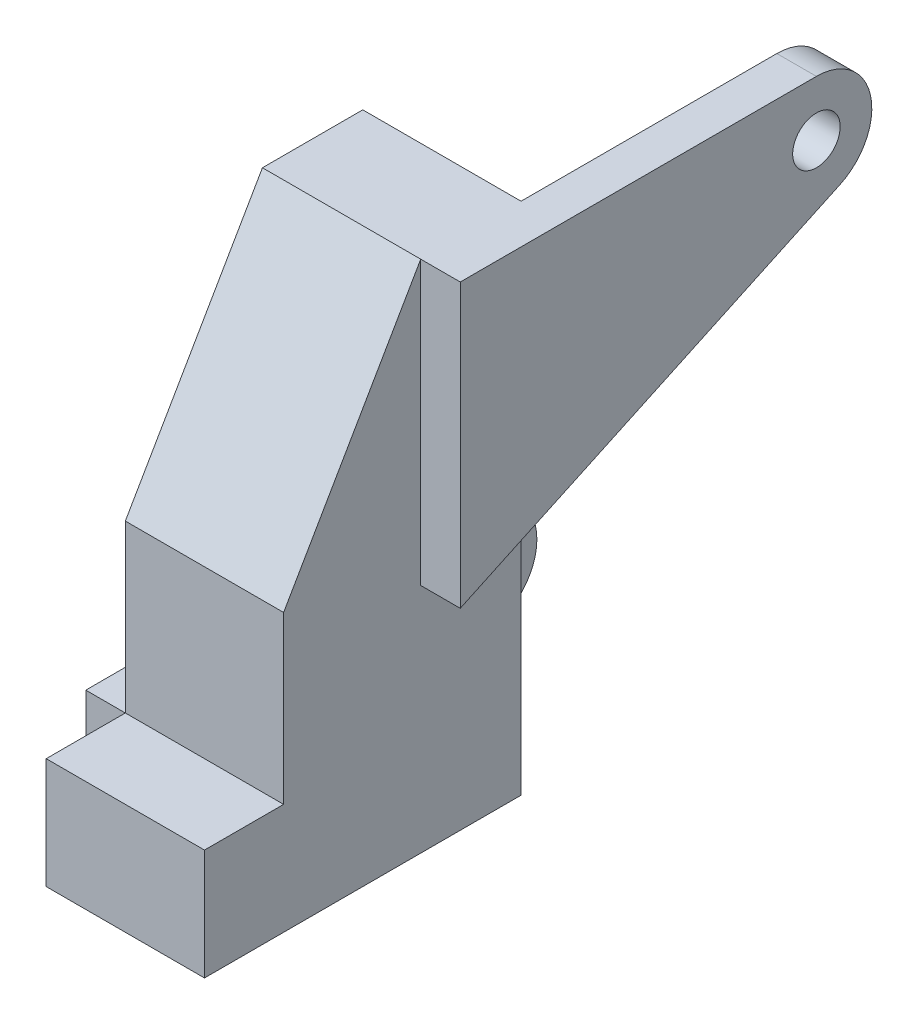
ISO-10303-21;
HEADER;
FILE_DESCRIPTION(('STEP AP214'),'2;1');
FILE_NAME('part.step','',(''),(''),'','','');
FILE_SCHEMA(('AUTOMOTIVE_DESIGN { 1 0 10303 214 1 1 1 1 }'));
ENDSEC;
DATA;
#1=APPLICATION_CONTEXT('core data for automotive mechanical design processes');
#2=APPLICATION_PROTOCOL_DEFINITION('international standard','automotive_design',2000,#1);
#3=PRODUCT_CONTEXT('',#1,'mechanical');
#4=PRODUCT('Part','Part','',(#3));
#5=PRODUCT_RELATED_PRODUCT_CATEGORY('part','',(#4));
#6=PRODUCT_DEFINITION_FORMATION('','',#4);
#7=PRODUCT_DEFINITION_CONTEXT('part definition',#1,'design');
#8=PRODUCT_DEFINITION('design','',#6,#7);
#9=PRODUCT_DEFINITION_SHAPE('','',#8);
#10=(LENGTH_UNIT() NAMED_UNIT(*) SI_UNIT(.MILLI.,.METRE.));
#11=(NAMED_UNIT(*) PLANE_ANGLE_UNIT() SI_UNIT($,.RADIAN.));
#12=(NAMED_UNIT(*) SI_UNIT($,.STERADIAN.) SOLID_ANGLE_UNIT());
#13=UNCERTAINTY_MEASURE_WITH_UNIT(LENGTH_MEASURE(1.E-05),#10,'distance_accuracy_value','');
#14=(GEOMETRIC_REPRESENTATION_CONTEXT(3) GLOBAL_UNCERTAINTY_ASSIGNED_CONTEXT((#13)) GLOBAL_UNIT_ASSIGNED_CONTEXT((#10,
#11,#12)) REPRESENTATION_CONTEXT('',''));
#15=CARTESIAN_POINT('',(0.,0.,0.));
#16=DIRECTION('',(0.,0.,1.));
#17=DIRECTION('',(1.,0.,0.));
#18=AXIS2_PLACEMENT_3D('',#15,#16,#17);
#19=CARTESIAN_POINT('',(0.,0.,0.));
#20=DIRECTION('',(-1.,0.,0.));
#21=DIRECTION('',(0.,0.,1.));
#22=AXIS2_PLACEMENT_3D('',#19,#20,#21);
#23=PLANE('',#22);
#24=DIRECTION('',(0.,0.,-1.));
#25=VECTOR('',#24,1.);
#26=CARTESIAN_POINT('',(0.,14.,-10.));
#27=LINE('',#26,#25);
#28=CARTESIAN_POINT('',(0.,14.,-10.));
#29=VERTEX_POINT('',#28);
#30=CARTESIAN_POINT('',(0.,14.,-40.));
#31=VERTEX_POINT('',#30);
#32=EDGE_CURVE('E177',#29,#31,#27,.T.);
#33=ORIENTED_EDGE('',*,*,#32,.F.);
#34=DIRECTION('',(0.,-1.,0.));
#35=VECTOR('',#34,1.);
#36=CARTESIAN_POINT('',(0.,14.,-10.));
#37=LINE('',#36,#35);
#38=CARTESIAN_POINT('',(0.,35.,-10.));
#39=VERTEX_POINT('',#38);
#40=EDGE_CURVE('E277',#39,#29,#37,.T.);
#41=ORIENTED_EDGE('',*,*,#40,.F.);
#42=DIRECTION('',(0.,-0.866025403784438,0.500000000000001));
#43=VECTOR('',#42,1.);
#44=CARTESIAN_POINT('',(0.,35.,-10.));
#45=LINE('',#44,#43);
#46=CARTESIAN_POINT('',(0.,65.,-27.3205080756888));
#47=VERTEX_POINT('',#46);
#48=EDGE_CURVE('E274',#47,#39,#45,.T.);
#49=ORIENTED_EDGE('',*,*,#48,.F.);
#50=DIRECTION('',(0.,0.,1.));
#51=VECTOR('',#50,1.);
#52=CARTESIAN_POINT('',(0.,65.,-27.3205080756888));
#53=LINE('',#52,#51);
#54=CARTESIAN_POINT('',(0.,65.,-40.));
#55=VERTEX_POINT('',#54);
#56=EDGE_CURVE('E271',#55,#47,#53,.T.);
#57=ORIENTED_EDGE('',*,*,#56,.F.);
#58=DIRECTION('',(0.,1.,0.));
#59=VECTOR('',#58,1.);
#60=CARTESIAN_POINT('',(0.,65.,-40.));
#61=LINE('',#60,#59);
#62=EDGE_CURVE('E61',#31,#55,#61,.T.);
#63=ORIENTED_EDGE('',*,*,#62,.F.);
#64=EDGE_LOOP('',(#33,#41,#49,#57,#63));
#65=FACE_BOUND('',#64,.T.);
#66=ADVANCED_FACE('F45',(#65),#23,.T.);
#67=CARTESIAN_POINT('',(20.,0.,0.));
#68=DIRECTION('',(-1.,0.,0.));
#69=DIRECTION('',(0.,0.,1.));
#70=AXIS2_PLACEMENT_3D('',#67,#68,#69);
#71=PLANE('',#70);
#72=DIRECTION('',(0.,0.422618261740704,-0.906307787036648));
#73=VECTOR('',#72,1.);
#74=CARTESIAN_POINT('',(20.,29.2925099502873,-27.3205080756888));
#75=LINE('',#74,#73);
#76=CARTESIAN_POINT('',(20.,29.2925099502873,-27.3205080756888));
#77=VERTEX_POINT('',#76);
#78=CARTESIAN_POINT('',(20.,35.2050541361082,-40.));
#79=VERTEX_POINT('',#78);
#80=EDGE_CURVE('E221',#77,#79,#75,.T.);
#81=ORIENTED_EDGE('',*,*,#80,.F.);
#82=DIRECTION('',(0.,-1.,0.));
#83=VECTOR('',#82,1.);
#84=CARTESIAN_POINT('',(20.,65.,-27.3205080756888));
#85=LINE('',#84,#83);
#86=CARTESIAN_POINT('',(20.,65.,-27.3205080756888));
#87=VERTEX_POINT('',#86);
#88=EDGE_CURVE('E216',#87,#77,#85,.T.);
#89=ORIENTED_EDGE('',*,*,#88,.F.);
#90=DIRECTION('',(0.,-0.866025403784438,0.500000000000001));
#91=VECTOR('',#90,1.);
#92=CARTESIAN_POINT('',(20.,35.,-10.));
#93=LINE('',#92,#91);
#94=CARTESIAN_POINT('',(20.,35.,-10.));
#95=VERTEX_POINT('',#94);
#96=EDGE_CURVE('E253',#87,#95,#93,.T.);
#97=ORIENTED_EDGE('',*,*,#96,.T.);
#98=DIRECTION('',(0.,-1.,0.));
#99=VECTOR('',#98,1.);
#100=CARTESIAN_POINT('',(20.,14.,-10.));
#101=LINE('',#100,#99);
#102=CARTESIAN_POINT('',(20.,14.,-10.));
#103=VERTEX_POINT('',#102);
#104=EDGE_CURVE('E256',#95,#103,#101,.T.);
#105=ORIENTED_EDGE('',*,*,#104,.T.);
#106=DIRECTION('',(0.,0.,1.));
#107=VECTOR('',#106,1.);
#108=CARTESIAN_POINT('',(20.,14.,0.));
#109=LINE('',#108,#107);
#110=CARTESIAN_POINT('',(20.,14.,0.));
#111=VERTEX_POINT('',#110);
#112=EDGE_CURVE('E259',#103,#111,#109,.T.);
#113=ORIENTED_EDGE('',*,*,#112,.T.);
#114=DIRECTION('',(0.,-1.,0.));
#115=VECTOR('',#114,1.);
#116=CARTESIAN_POINT('',(20.,0.,0.));
#117=LINE('',#116,#115);
#118=CARTESIAN_POINT('',(20.,0.,0.));
#119=VERTEX_POINT('',#118);
#120=EDGE_CURVE('E262',#111,#119,#117,.T.);
#121=ORIENTED_EDGE('',*,*,#120,.T.);
#122=DIRECTION('',(0.,0.,-1.));
#123=VECTOR('',#122,1.);
#124=CARTESIAN_POINT('',(20.,-4.031179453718E-13,-40.));
#125=LINE('',#124,#123);
#126=CARTESIAN_POINT('',(20.,-4.031179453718E-13,-40.));
#127=VERTEX_POINT('',#126);
#128=EDGE_CURVE('E243',#119,#127,#125,.T.);
#129=ORIENTED_EDGE('',*,*,#128,.T.);
#130=DIRECTION('',(0.,1.,0.));
#131=VECTOR('',#130,1.);
#132=CARTESIAN_POINT('',(20.,65.,-40.));
#133=LINE('',#132,#131);
#134=EDGE_CURVE('E249',#127,#79,#133,.T.);
#135=ORIENTED_EDGE('',*,*,#134,.T.);
#136=EDGE_LOOP('',(#81,#89,#97,#105,#113,#121,#129,#135));
#137=FACE_BOUND('',#136,.T.);
#138=ADVANCED_FACE('F324',(#137),#71,.F.);
#139=CARTESIAN_POINT('',(20.,-4.031179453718E-13,-40.));
#140=DIRECTION('',(0.,1.,0.));
#141=DIRECTION('',(0.,0.,1.));
#142=AXIS2_PLACEMENT_3D('',#139,#140,#141);
#143=PLANE('',#142);
#144=DIRECTION('',(0.,0.,-1.));
#145=VECTOR('',#144,1.);
#146=CARTESIAN_POINT('',(0.,-4.031179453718E-13,-40.));
#147=LINE('',#146,#145);
#148=CARTESIAN_POINT('',(0.,0.,0.));
#149=VERTEX_POINT('',#148);
#150=CARTESIAN_POINT('',(0.,-1.0077948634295E-13,-10.));
#151=VERTEX_POINT('',#150);
#152=EDGE_CURVE('E242',#149,#151,#147,.T.);
#153=ORIENTED_EDGE('',*,*,#152,.T.);
#154=DIRECTION('',(1.,0.,0.));
#155=VECTOR('',#154,1.);
#156=CARTESIAN_POINT('',(-5.,0.,-10.));
#157=LINE('',#156,#155);
#158=CARTESIAN_POINT('',(-5.,0.,-10.));
#159=VERTEX_POINT('',#158);
#160=EDGE_CURVE('E161',#159,#151,#157,.T.);
#161=ORIENTED_EDGE('',*,*,#160,.F.);
#162=DIRECTION('',(0.,0.,1.));
#163=VECTOR('',#162,1.);
#164=CARTESIAN_POINT('',(-5.,0.,-55.));
#165=LINE('',#164,#163);
#166=CARTESIAN_POINT('',(-5.,0.,-55.));
#167=VERTEX_POINT('',#166);
#168=EDGE_CURVE('E154',#167,#159,#165,.T.);
#169=ORIENTED_EDGE('',*,*,#168,.F.);
#170=DIRECTION('',(1.,0.,0.));
#171=VECTOR('',#170,1.);
#172=CARTESIAN_POINT('',(-5.,0.,-55.));
#173=LINE('',#172,#171);
#174=CARTESIAN_POINT('',(0.,0.,-55.));
#175=VERTEX_POINT('',#174);
#176=EDGE_CURVE('E158',#167,#175,#173,.T.);
#177=ORIENTED_EDGE('',*,*,#176,.T.);
#178=DIRECTION('',(0.,0.,1.));
#179=VECTOR('',#178,1.);
#180=CARTESIAN_POINT('',(0.,0.,-55.));
#181=LINE('',#180,#179);
#182=CARTESIAN_POINT('',(0.,-4.031179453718E-13,-40.));
#183=VERTEX_POINT('',#182);
#184=EDGE_CURVE('E358',#175,#183,#181,.T.);
#185=ORIENTED_EDGE('',*,*,#184,.T.);
#186=DIRECTION('',(-1.,0.,0.));
#187=VECTOR('',#186,1.);
#188=CARTESIAN_POINT('',(20.,-4.031179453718E-13,-40.));
#189=LINE('',#188,#187);
#190=EDGE_CURVE('E11',#127,#183,#189,.T.);
#191=ORIENTED_EDGE('',*,*,#190,.F.);
#192=ORIENTED_EDGE('',*,*,#128,.F.);
#193=DIRECTION('',(-1.,0.,0.));
#194=VECTOR('',#193,1.);
#195=CARTESIAN_POINT('',(20.,0.,0.));
#196=LINE('',#195,#194);
#197=EDGE_CURVE('E265',#119,#149,#196,.T.);
#198=ORIENTED_EDGE('',*,*,#197,.T.);
#199=EDGE_LOOP('',(#153,#161,#169,#177,#185,#191,#192,#198));
#200=FACE_BOUND('',#199,.T.);
#201=ADVANCED_FACE('F47',(#200),#143,.F.);
#202=CARTESIAN_POINT('',(20.,65.,-40.));
#203=DIRECTION('',(0.,0.,1.));
#204=DIRECTION('',(0.,-1.,0.));
#205=AXIS2_PLACEMENT_3D('',#202,#203,#204);
#206=PLANE('',#205);
#207=EDGE_CURVE('E268',#183,#31,#61,.T.);
#208=ORIENTED_EDGE('',*,*,#207,.T.);
#209=ORIENTED_EDGE('',*,*,#62,.T.);
#210=DIRECTION('',(-1.,0.,0.));
#211=VECTOR('',#210,1.);
#212=CARTESIAN_POINT('',(20.,65.,-40.));
#213=LINE('',#212,#211);
#214=CARTESIAN_POINT('',(20.,65.,-40.));
#215=VERTEX_POINT('',#214);
#216=EDGE_CURVE('E54',#215,#55,#213,.T.);
#217=ORIENTED_EDGE('',*,*,#216,.F.);
#218=EDGE_CURVE('E247',#79,#215,#133,.T.);
#219=ORIENTED_EDGE('',*,*,#218,.F.);
#220=ORIENTED_EDGE('',*,*,#134,.F.);
#221=ORIENTED_EDGE('',*,*,#190,.T.);
#222=EDGE_LOOP('',(#208,#209,#217,#219,#220,#221));
#223=FACE_BOUND('',#222,.T.);
#224=ADVANCED_FACE('F352',(#223),#206,.F.);
#225=CARTESIAN_POINT('',(20.,65.,-27.3205080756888));
#226=DIRECTION('',(0.,-1.,0.));
#227=DIRECTION('',(0.,0.,-1.));
#228=AXIS2_PLACEMENT_3D('',#225,#226,#227);
#229=PLANE('',#228);
#230=ORIENTED_EDGE('',*,*,#56,.T.);
#231=DIRECTION('',(-1.,0.,0.));
#232=VECTOR('',#231,1.);
#233=CARTESIAN_POINT('',(20.,65.,-27.3205080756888));
#234=LINE('',#233,#232);
#235=EDGE_CURVE('E301',#87,#47,#234,.T.);
#236=ORIENTED_EDGE('',*,*,#235,.F.);
#237=DIRECTION('',(-1.,0.,0.));
#238=VECTOR('',#237,1.);
#239=CARTESIAN_POINT('',(25.,65.,-27.3205080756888));
#240=LINE('',#239,#238);
#241=CARTESIAN_POINT('',(25.,65.,-27.3205080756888));
#242=VERTEX_POINT('',#241);
#243=EDGE_CURVE('E238',#242,#87,#240,.T.);
#244=ORIENTED_EDGE('',*,*,#243,.F.);
#245=DIRECTION('',(0.,0.,1.));
#246=VECTOR('',#245,1.);
#247=CARTESIAN_POINT('',(25.,65.,-72.3205080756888));
#248=LINE('',#247,#246);
#249=CARTESIAN_POINT('',(25.,65.,-72.3205080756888));
#250=VERTEX_POINT('',#249);
#251=EDGE_CURVE('E198',#250,#242,#248,.T.);
#252=ORIENTED_EDGE('',*,*,#251,.F.);
#253=DIRECTION('',(-1.,0.,0.));
#254=VECTOR('',#253,1.);
#255=CARTESIAN_POINT('',(25.,65.,-72.3205080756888));
#256=LINE('',#255,#254);
#257=CARTESIAN_POINT('',(20.,65.,-72.3205080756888));
#258=VERTEX_POINT('',#257);
#259=EDGE_CURVE('E212',#250,#258,#256,.T.);
#260=ORIENTED_EDGE('',*,*,#259,.T.);
#261=DIRECTION('',(0.,0.,1.));
#262=VECTOR('',#261,1.);
#263=CARTESIAN_POINT('',(20.,65.,-72.3205080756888));
#264=LINE('',#263,#262);
#265=EDGE_CURVE('E196',#258,#215,#264,.T.);
#266=ORIENTED_EDGE('',*,*,#265,.T.);
#267=ORIENTED_EDGE('',*,*,#216,.T.);
#268=EDGE_LOOP('',(#230,#236,#244,#252,#260,#266,#267));
#269=FACE_BOUND('',#268,.T.);
#270=ADVANCED_FACE('F307',(#269),#229,.F.);
#271=CARTESIAN_POINT('',(20.,35.,-10.));
#272=DIRECTION('',(0.,-0.500000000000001,-0.866025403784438));
#273=DIRECTION('',(0.,0.866025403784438,-0.500000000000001));
#274=AXIS2_PLACEMENT_3D('',#271,#272,#273);
#275=PLANE('',#274);
#276=ORIENTED_EDGE('',*,*,#48,.T.);
#277=DIRECTION('',(-1.,0.,0.));
#278=VECTOR('',#277,1.);
#279=CARTESIAN_POINT('',(20.,35.,-10.));
#280=LINE('',#279,#278);
#281=EDGE_CURVE('E297',#95,#39,#280,.T.);
#282=ORIENTED_EDGE('',*,*,#281,.F.);
#283=ORIENTED_EDGE('',*,*,#96,.F.);
#284=ORIENTED_EDGE('',*,*,#235,.T.);
#285=EDGE_LOOP('',(#276,#282,#283,#284));
#286=FACE_BOUND('',#285,.T.);
#287=ADVANCED_FACE('F316',(#286),#275,.F.);
#288=CARTESIAN_POINT('',(20.,14.,-10.));
#289=DIRECTION('',(0.,0.,-1.));
#290=DIRECTION('',(-1.,0.,0.));
#291=AXIS2_PLACEMENT_3D('',#288,#289,#290);
#292=PLANE('',#291);
#293=ORIENTED_EDGE('',*,*,#40,.T.);
#294=DIRECTION('',(-1.,0.,0.));
#295=VECTOR('',#294,1.);
#296=CARTESIAN_POINT('',(20.,14.,-10.));
#297=LINE('',#296,#295);
#298=EDGE_CURVE('E293',#103,#29,#297,.T.);
#299=ORIENTED_EDGE('',*,*,#298,.F.);
#300=ORIENTED_EDGE('',*,*,#104,.F.);
#301=ORIENTED_EDGE('',*,*,#281,.T.);
#302=EDGE_LOOP('',(#293,#299,#300,#301));
#303=FACE_BOUND('',#302,.T.);
#304=ADVANCED_FACE('F320',(#303),#292,.F.);
#305=CARTESIAN_POINT('',(20.,14.,0.));
#306=DIRECTION('',(0.,-1.,0.));
#307=DIRECTION('',(0.,0.,-1.));
#308=AXIS2_PLACEMENT_3D('',#305,#306,#307);
#309=PLANE('',#308);
#310=DIRECTION('',(0.,0.,1.));
#311=VECTOR('',#310,1.);
#312=CARTESIAN_POINT('',(0.,14.,0.));
#313=LINE('',#312,#311);
#314=CARTESIAN_POINT('',(0.,14.,0.));
#315=VERTEX_POINT('',#314);
#316=EDGE_CURVE('E281',#29,#315,#313,.T.);
#317=ORIENTED_EDGE('',*,*,#316,.T.);
#318=DIRECTION('',(-1.,0.,0.));
#319=VECTOR('',#318,1.);
#320=CARTESIAN_POINT('',(20.,14.,0.));
#321=LINE('',#320,#319);
#322=EDGE_CURVE('E289',#111,#315,#321,.T.);
#323=ORIENTED_EDGE('',*,*,#322,.F.);
#324=ORIENTED_EDGE('',*,*,#112,.F.);
#325=ORIENTED_EDGE('',*,*,#298,.T.);
#326=EDGE_LOOP('',(#317,#323,#324,#325));
#327=FACE_BOUND('',#326,.T.);
#328=ADVANCED_FACE('F423',(#327),#309,.F.);
#329=CARTESIAN_POINT('',(20.,0.,0.));
#330=DIRECTION('',(0.,0.,-1.));
#331=DIRECTION('',(-1.,0.,0.));
#332=AXIS2_PLACEMENT_3D('',#329,#330,#331);
#333=PLANE('',#332);
#334=DIRECTION('',(0.,-1.,0.));
#335=VECTOR('',#334,1.);
#336=CARTESIAN_POINT('',(0.,0.,0.));
#337=LINE('',#336,#335);
#338=EDGE_CURVE('E248',#315,#149,#337,.T.);
#339=ORIENTED_EDGE('',*,*,#338,.T.);
#340=ORIENTED_EDGE('',*,*,#197,.F.);
#341=ORIENTED_EDGE('',*,*,#120,.F.);
#342=ORIENTED_EDGE('',*,*,#322,.T.);
#343=EDGE_LOOP('',(#339,#340,#341,#342));
#344=FACE_BOUND('',#343,.T.);
#345=ADVANCED_FACE('F416',(#344),#333,.F.);
#346=DIRECTION('',(0.,1.,0.));
#347=VECTOR('',#346,1.);
#348=CARTESIAN_POINT('',(0.,14.,-10.));
#349=LINE('',#348,#347);
#350=EDGE_CURVE('E69',#151,#29,#349,.T.);
#351=ORIENTED_EDGE('',*,*,#350,.F.);
#352=ORIENTED_EDGE('',*,*,#152,.F.);
#353=ORIENTED_EDGE('',*,*,#338,.F.);
#354=ORIENTED_EDGE('',*,*,#316,.F.);
#355=EDGE_LOOP('',(#351,#352,#353,#354));
#356=FACE_BOUND('',#355,.T.);
#357=ADVANCED_FACE('F409',(#356),#23,.T.);
#358=CARTESIAN_POINT('',(25.,58.,-72.3205080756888));
#359=DIRECTION('',(-1.,0.,0.));
#360=DIRECTION('',(0.,0.,1.));
#361=AXIS2_PLACEMENT_3D('',#358,#359,#360);
#362=PLANE('',#361);
#363=ORIENTED_EDGE('',*,*,#251,.T.);
#364=DIRECTION('',(0.,-1.,0.));
#365=VECTOR('',#364,1.);
#366=CARTESIAN_POINT('',(25.,65.,-27.3205080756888));
#367=LINE('',#366,#365);
#368=CARTESIAN_POINT('',(25.,29.2925099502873,-27.3205080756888));
#369=VERTEX_POINT('',#368);
#370=EDGE_CURVE('E202',#242,#369,#367,.T.);
#371=ORIENTED_EDGE('',*,*,#370,.T.);
#372=DIRECTION('',(0.,0.422618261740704,-0.906307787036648));
#373=VECTOR('',#372,1.);
#374=CARTESIAN_POINT('',(25.,29.2925099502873,-27.3205080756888));
#375=LINE('',#374,#373);
#376=CARTESIAN_POINT('',(25.,51.6558454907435,-75.2788359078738));
#377=VERTEX_POINT('',#376);
#378=EDGE_CURVE('E206',#369,#377,#375,.T.);
#379=ORIENTED_EDGE('',*,*,#378,.T.);
#380=CARTESIAN_POINT('',(25.,58.,-72.3205080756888));
#381=DIRECTION('',(1.,0.,0.));
#382=DIRECTION('',(0.,0.,1.));
#383=AXIS2_PLACEMENT_3D('',#380,#381,#382);
#384=CIRCLE('',#383,6.99999999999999);
#385=EDGE_CURVE('E209',#377,#250,#384,.T.);
#386=ORIENTED_EDGE('',*,*,#385,.T.);
#387=EDGE_LOOP('',(#363,#371,#379,#386));
#388=FACE_BOUND('',#387,.T.);
#389=CARTESIAN_POINT('',(25.,58.,-72.3205080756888));
#390=DIRECTION('',(1.,0.,0.));
#391=DIRECTION('',(0.,0.,-1.));
#392=AXIS2_PLACEMENT_3D('',#389,#390,#391);
#393=CIRCLE('',#392,3.00000000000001);
#394=CARTESIAN_POINT('',(25.,58.,-75.3205080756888));
#395=VERTEX_POINT('',#394);
#396=EDGE_CURVE('E188',#395,#395,#393,.T.);
#397=ORIENTED_EDGE('',*,*,#396,.F.);
#398=EDGE_LOOP('',(#397));
#399=FACE_BOUND('',#398,.T.);
#400=ADVANCED_FACE('F333',(#388,#399),#362,.F.);
#401=CARTESIAN_POINT('',(20.,58.,-72.3205080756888));
#402=DIRECTION('',(-1.,0.,0.));
#403=DIRECTION('',(0.,0.,1.));
#404=AXIS2_PLACEMENT_3D('',#401,#402,#403);
#405=PLANE('',#404);
#406=CARTESIAN_POINT('',(20.,51.6558454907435,-75.2788359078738));
#407=VERTEX_POINT('',#406);
#408=EDGE_CURVE('E220',#79,#407,#75,.T.);
#409=ORIENTED_EDGE('',*,*,#408,.F.);
#410=ORIENTED_EDGE('',*,*,#218,.T.);
#411=ORIENTED_EDGE('',*,*,#265,.F.);
#412=CARTESIAN_POINT('',(20.,58.,-72.3205080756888));
#413=DIRECTION('',(1.,0.,0.));
#414=DIRECTION('',(0.,0.,1.));
#415=AXIS2_PLACEMENT_3D('',#412,#413,#414);
#416=CIRCLE('',#415,6.99999999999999);
#417=EDGE_CURVE('E203',#407,#258,#416,.T.);
#418=ORIENTED_EDGE('',*,*,#417,.F.);
#419=EDGE_LOOP('',(#409,#410,#411,#418));
#420=FACE_BOUND('',#419,.T.);
#421=CARTESIAN_POINT('',(20.,58.,-72.3205080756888));
#422=DIRECTION('',(1.,0.,0.));
#423=DIRECTION('',(0.,0.,-1.));
#424=AXIS2_PLACEMENT_3D('',#421,#422,#423);
#425=CIRCLE('',#424,3.00000000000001);
#426=CARTESIAN_POINT('',(20.,58.,-75.3205080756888));
#427=VERTEX_POINT('',#426);
#428=EDGE_CURVE('E183',#427,#427,#425,.T.);
#429=ORIENTED_EDGE('',*,*,#428,.T.);
#430=EDGE_LOOP('',(#429));
#431=FACE_BOUND('',#430,.T.);
#432=ADVANCED_FACE('F343',(#420,#431),#405,.T.);
#433=CARTESIAN_POINT('',(25.,65.,-27.3205080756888));
#434=DIRECTION('',(0.,0.,-1.));
#435=DIRECTION('',(0.,1.,0.));
#436=AXIS2_PLACEMENT_3D('',#433,#434,#435);
#437=PLANE('',#436);
#438=ORIENTED_EDGE('',*,*,#88,.T.);
#439=DIRECTION('',(-1.,0.,0.));
#440=VECTOR('',#439,1.);
#441=CARTESIAN_POINT('',(25.,29.2925099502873,-27.3205080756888));
#442=LINE('',#441,#440);
#443=EDGE_CURVE('E234',#369,#77,#442,.T.);
#444=ORIENTED_EDGE('',*,*,#443,.F.);
#445=ORIENTED_EDGE('',*,*,#370,.F.);
#446=ORIENTED_EDGE('',*,*,#243,.T.);
#447=EDGE_LOOP('',(#438,#444,#445,#446));
#448=FACE_BOUND('',#447,.T.);
#449=ADVANCED_FACE('F328',(#448),#437,.F.);
#450=CARTESIAN_POINT('',(25.,29.2925099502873,-27.3205080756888));
#451=DIRECTION('',(0.,0.906307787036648,0.422618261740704));
#452=DIRECTION('',(0.,-0.422618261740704,0.906307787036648));
#453=AXIS2_PLACEMENT_3D('',#450,#451,#452);
#454=PLANE('',#453);
#455=ORIENTED_EDGE('',*,*,#80,.T.);
#456=ORIENTED_EDGE('',*,*,#408,.T.);
#457=DIRECTION('',(-1.,0.,0.));
#458=VECTOR('',#457,1.);
#459=CARTESIAN_POINT('',(25.,51.6558454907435,-75.2788359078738));
#460=LINE('',#459,#458);
#461=EDGE_CURVE('E230',#377,#407,#460,.T.);
#462=ORIENTED_EDGE('',*,*,#461,.F.);
#463=ORIENTED_EDGE('',*,*,#378,.F.);
#464=ORIENTED_EDGE('',*,*,#443,.T.);
#465=EDGE_LOOP('',(#455,#456,#462,#463,#464));
#466=FACE_BOUND('',#465,.T.);
#467=ADVANCED_FACE('F349',(#466),#454,.F.);
#468=CARTESIAN_POINT('',(25.,58.,-72.3205080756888));
#469=DIRECTION('',(-1.,0.,0.));
#470=DIRECTION('',(0.,0.,1.));
#471=AXIS2_PLACEMENT_3D('',#468,#469,#470);
#472=CYLINDRICAL_SURFACE('',#471,6.99999999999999);
#473=ORIENTED_EDGE('',*,*,#417,.T.);
#474=ORIENTED_EDGE('',*,*,#259,.F.);
#475=ORIENTED_EDGE('',*,*,#385,.F.);
#476=ORIENTED_EDGE('',*,*,#461,.T.);
#477=EDGE_LOOP('',(#473,#474,#475,#476));
#478=FACE_BOUND('',#477,.T.);
#479=ADVANCED_FACE('F339',(#478),#472,.T.);
#480=CARTESIAN_POINT('',(25.,58.,-72.3205080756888));
#481=DIRECTION('',(-1.,0.,0.));
#482=DIRECTION('',(0.,0.,1.));
#483=AXIS2_PLACEMENT_3D('',#480,#481,#482);
#484=CYLINDRICAL_SURFACE('',#483,3.00000000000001);
#485=ORIENTED_EDGE('',*,*,#396,.T.);
#486=EDGE_LOOP('',(#485));
#487=FACE_BOUND('',#486,.T.);
#488=ORIENTED_EDGE('',*,*,#428,.F.);
#489=EDGE_LOOP('',(#488));
#490=FACE_BOUND('',#489,.T.);
#491=ADVANCED_FACE('F396',(#487,#490),#484,.F.);
#492=CARTESIAN_POINT('',(-5.,7.,-55.));
#493=DIRECTION('',(-1.,0.,0.));
#494=DIRECTION('',(0.,0.,1.));
#495=AXIS2_PLACEMENT_3D('',#492,#493,#494);
#496=PLANE('',#495);
#497=CARTESIAN_POINT('',(-5.,7.,-55.));
#498=DIRECTION('',(-1.,0.,0.));
#499=DIRECTION('',(0.,0.,1.));
#500=AXIS2_PLACEMENT_3D('',#497,#498,#499);
#501=CIRCLE('',#500,7.);
#502=CARTESIAN_POINT('',(-5.,14.,-55.));
#503=VERTEX_POINT('',#502);
#504=EDGE_CURVE('E166',#503,#167,#501,.T.);
#505=ORIENTED_EDGE('',*,*,#504,.T.);
#506=ORIENTED_EDGE('',*,*,#168,.T.);
#507=DIRECTION('',(0.,1.,0.));
#508=VECTOR('',#507,1.);
#509=CARTESIAN_POINT('',(-5.,14.,-10.));
#510=LINE('',#509,#508);
#511=CARTESIAN_POINT('',(-5.,14.,-10.));
#512=VERTEX_POINT('',#511);
#513=EDGE_CURVE('E165',#159,#512,#510,.T.);
#514=ORIENTED_EDGE('',*,*,#513,.T.);
#515=DIRECTION('',(0.,0.,-1.));
#516=VECTOR('',#515,1.);
#517=CARTESIAN_POINT('',(-5.,14.,-10.));
#518=LINE('',#517,#516);
#519=EDGE_CURVE('E172',#512,#503,#518,.T.);
#520=ORIENTED_EDGE('',*,*,#519,.T.);
#521=EDGE_LOOP('',(#505,#506,#514,#520));
#522=FACE_BOUND('',#521,.T.);
#523=CARTESIAN_POINT('',(-5.,7.,-55.));
#524=DIRECTION('',(-1.,0.,0.));
#525=DIRECTION('',(0.,0.,1.));
#526=AXIS2_PLACEMENT_3D('',#523,#524,#525);
#527=CIRCLE('',#526,3.5);
#528=CARTESIAN_POINT('',(-5.,7.,-51.5));
#529=VERTEX_POINT('',#528);
#530=EDGE_CURVE('E366',#529,#529,#527,.T.);
#531=ORIENTED_EDGE('',*,*,#530,.F.);
#532=EDGE_LOOP('',(#531));
#533=FACE_BOUND('',#532,.T.);
#534=ADVANCED_FACE('F169',(#522,#533),#496,.T.);
#535=CARTESIAN_POINT('',(0.,7.,-55.));
#536=DIRECTION('',(-1.,0.,0.));
#537=DIRECTION('',(0.,0.,1.));
#538=AXIS2_PLACEMENT_3D('',#535,#536,#537);
#539=PLANE('',#538);
#540=ORIENTED_EDGE('',*,*,#207,.F.);
#541=ORIENTED_EDGE('',*,*,#184,.F.);
#542=CARTESIAN_POINT('',(0.,7.,-55.));
#543=DIRECTION('',(-1.,0.,0.));
#544=DIRECTION('',(0.,0.,1.));
#545=AXIS2_PLACEMENT_3D('',#542,#543,#544);
#546=CIRCLE('',#545,7.);
#547=CARTESIAN_POINT('',(0.,14.,-55.));
#548=VERTEX_POINT('',#547);
#549=EDGE_CURVE('E181',#548,#175,#546,.T.);
#550=ORIENTED_EDGE('',*,*,#549,.F.);
#551=EDGE_CURVE('E359',#31,#548,#27,.T.);
#552=ORIENTED_EDGE('',*,*,#551,.F.);
#553=EDGE_LOOP('',(#540,#541,#550,#552));
#554=FACE_BOUND('',#553,.T.);
#555=CARTESIAN_POINT('',(0.,7.,-55.));
#556=DIRECTION('',(-1.,0.,0.));
#557=DIRECTION('',(0.,0.,1.));
#558=AXIS2_PLACEMENT_3D('',#555,#556,#557);
#559=CIRCLE('',#558,3.5);
#560=CARTESIAN_POINT('',(0.,7.,-51.5));
#561=VERTEX_POINT('',#560);
#562=EDGE_CURVE('E385',#561,#561,#559,.T.);
#563=ORIENTED_EDGE('',*,*,#562,.T.);
#564=EDGE_LOOP('',(#563));
#565=FACE_BOUND('',#564,.T.);
#566=ADVANCED_FACE('F356',(#554,#565),#539,.F.);
#567=CARTESIAN_POINT('',(-5.,7.,-55.));
#568=DIRECTION('',(1.,0.,0.));
#569=DIRECTION('',(0.,0.,-1.));
#570=AXIS2_PLACEMENT_3D('',#567,#568,#569);
#571=CYLINDRICAL_SURFACE('',#570,7.);
#572=ORIENTED_EDGE('',*,*,#549,.T.);
#573=ORIENTED_EDGE('',*,*,#176,.F.);
#574=ORIENTED_EDGE('',*,*,#504,.F.);
#575=DIRECTION('',(1.,0.,0.));
#576=VECTOR('',#575,1.);
#577=CARTESIAN_POINT('',(-5.,14.,-55.));
#578=LINE('',#577,#576);
#579=EDGE_CURVE('E372',#503,#548,#578,.T.);
#580=ORIENTED_EDGE('',*,*,#579,.T.);
#581=EDGE_LOOP('',(#572,#573,#574,#580));
#582=FACE_BOUND('',#581,.T.);
#583=ADVANCED_FACE('F179',(#582),#571,.T.);
#584=CARTESIAN_POINT('',(-5.,14.,-10.));
#585=DIRECTION('',(0.,0.,-1.));
#586=DIRECTION('',(0.,1.,0.));
#587=AXIS2_PLACEMENT_3D('',#584,#585,#586);
#588=PLANE('',#587);
#589=ORIENTED_EDGE('',*,*,#350,.T.);
#590=DIRECTION('',(1.,0.,0.));
#591=VECTOR('',#590,1.);
#592=CARTESIAN_POINT('',(-5.,14.,-10.));
#593=LINE('',#592,#591);
#594=EDGE_CURVE('E190',#512,#29,#593,.T.);
#595=ORIENTED_EDGE('',*,*,#594,.F.);
#596=ORIENTED_EDGE('',*,*,#513,.F.);
#597=ORIENTED_EDGE('',*,*,#160,.T.);
#598=EDGE_LOOP('',(#589,#595,#596,#597));
#599=FACE_BOUND('',#598,.T.);
#600=ADVANCED_FACE('F380',(#599),#588,.F.);
#601=CARTESIAN_POINT('',(-5.,14.,-10.));
#602=DIRECTION('',(0.,-1.,0.));
#603=DIRECTION('',(0.,0.,-1.));
#604=AXIS2_PLACEMENT_3D('',#601,#602,#603);
#605=PLANE('',#604);
#606=ORIENTED_EDGE('',*,*,#32,.T.);
#607=ORIENTED_EDGE('',*,*,#551,.T.);
#608=ORIENTED_EDGE('',*,*,#579,.F.);
#609=ORIENTED_EDGE('',*,*,#519,.F.);
#610=ORIENTED_EDGE('',*,*,#594,.T.);
#611=EDGE_LOOP('',(#606,#607,#608,#609,#610));
#612=FACE_BOUND('',#611,.T.);
#613=ADVANCED_FACE('F378',(#612),#605,.F.);
#614=CARTESIAN_POINT('',(-5.,7.,-55.));
#615=DIRECTION('',(1.,0.,0.));
#616=DIRECTION('',(0.,0.,-1.));
#617=AXIS2_PLACEMENT_3D('',#614,#615,#616);
#618=CYLINDRICAL_SURFACE('',#617,3.5);
#619=ORIENTED_EDGE('',*,*,#530,.T.);
#620=EDGE_LOOP('',(#619));
#621=FACE_BOUND('',#620,.T.);
#622=ORIENTED_EDGE('',*,*,#562,.F.);
#623=EDGE_LOOP('',(#622));
#624=FACE_BOUND('',#623,.T.);
#625=ADVANCED_FACE('F393',(#621,#624),#618,.F.);
#626=CLOSED_SHELL('',(#66,#138,#201,#224,#270,#287,#304,#328,#345,#357,#400,#432,#449,#467,#479,
#491,#534,#566,#583,#600,#613,#625));
#627=MANIFOLD_SOLID_BREP('B2',#626);
#628=ADVANCED_BREP_SHAPE_REPRESENTATION('',(#18,#627),#14);
#629=SHAPE_DEFINITION_REPRESENTATION(#9,#628);
ENDSEC;
END-ISO-10303-21;
